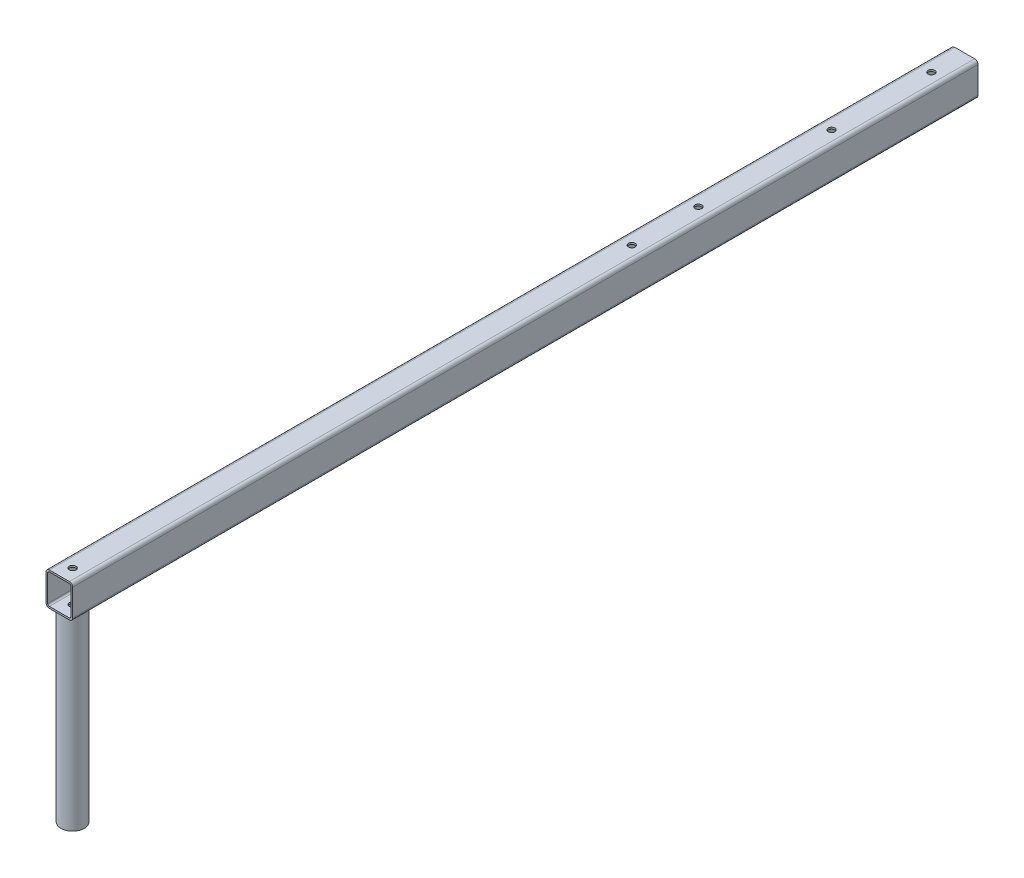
from build123d import *

# Parameters (mm, degrees)
SKETCH1_W           = 25.4
SKETCH1_H           = 31.75
SKETCH1_W_2         = 22.098
SKETCH1_H_2         = 28.448
EXTRUDE_THIN1_DEPTH = 863.6
FILLET1_R           = 3.175
FILLET2_R           = 1.5748
EXTRUDE_THIN2_START = -15.875
SKETCH2_R           = 11.1125
SKETCH2_R_2         = 9.4615
EXTRUDE_THIN2_DEPTH = 177.8
SKETCH3_R           = 3.175
CUT_EXTRUDE1_DEPTH  = 25.4
SKETCH4_R           = 3.175
CUT_EXTRUDE2_DEPTH  = 44.45


with BuildPart() as part:
    # Sketch1 → Extrude-Thin1 (new body)
    with BuildSketch(Plane.XY):
        Rectangle(SKETCH1_W, SKETCH1_H)
        Rectangle(SKETCH1_W_2, SKETCH1_H_2, mode=Mode.SUBTRACT)
    extrude(amount=EXTRUDE_THIN1_DEPTH)

    # Fillet1
    fillet1_edges = [part.edges().sort_by_distance(p)[0] for p in [
        (-12.7, 15.875, 431.8),
        (12.7, 15.875, 431.8),
        (12.7, -15.875, 431.8),
        (-12.7, -15.875, 431.8),
    ]]
    fillet(fillet1_edges, radius=FILLET1_R)

    # Fillet2
    fillet2_edges = [part.edges().sort_by_distance(p)[0] for p in [
        (-11.049, 14.224, 431.8),
        (-11.049, -14.224, 431.8),
        (11.049, -14.224, 431.8),
        (11.049, 14.224, 431.8),
    ]]
    fillet(fillet2_edges, radius=FILLET2_R)

    # Sketch3 → Cut-Extrude1 (cut, symmetric)
    with BuildSketch(Plane(origin=(0, 0, 0), x_dir=(1, 0, 0), z_dir=(0, 1, 0))):
        with Locations(Location((0, -31.75, 0), (0, 0, 90))):
            Circle(SKETCH3_R)
        with Locations(Location((0, -127, 0), (0, 0, 90))):
            Circle(SKETCH3_R)
        with Locations(Location((0, -254, 0), (0, 0, 90))):
            Circle(SKETCH3_R)
        with Locations(Location((0, -317.5, 0), (0, 0, 90))):
            Circle(SKETCH3_R)
    extrude(amount=CUT_EXTRUDE1_DEPTH, both=True, mode=Mode.SUBTRACT)

    # Sketch4 → Cut-Extrude2 (cut)
    with BuildSketch(Plane(origin=(0, 15.875, 0), x_dir=(1, 0, 0), z_dir=(0, 1, 0))):
        with Locations(Location((0, -850.9, 0), (0, 0, 270))):
            Circle(SKETCH4_R)
    extrude(amount=-CUT_EXTRUDE2_DEPTH, mode=Mode.SUBTRACT)


with BuildPart() as body_2:
    # Sketch2 → Extrude-Thin2 (new body)
    with BuildSketch(Plane(origin=(0, 0, 0), x_dir=(1, 0, 0), z_dir=(0, 1, 0)).offset(EXTRUDE_THIN2_START)):
        with Locations((0, -850.9)):
            Circle(SKETCH2_R)
        with Locations((0, -850.9)):
            Circle(SKETCH2_R_2, mode=Mode.SUBTRACT)
    extrude(amount=-EXTRUDE_THIN2_DEPTH)


solid = Compound([part.part, body_2.part])
